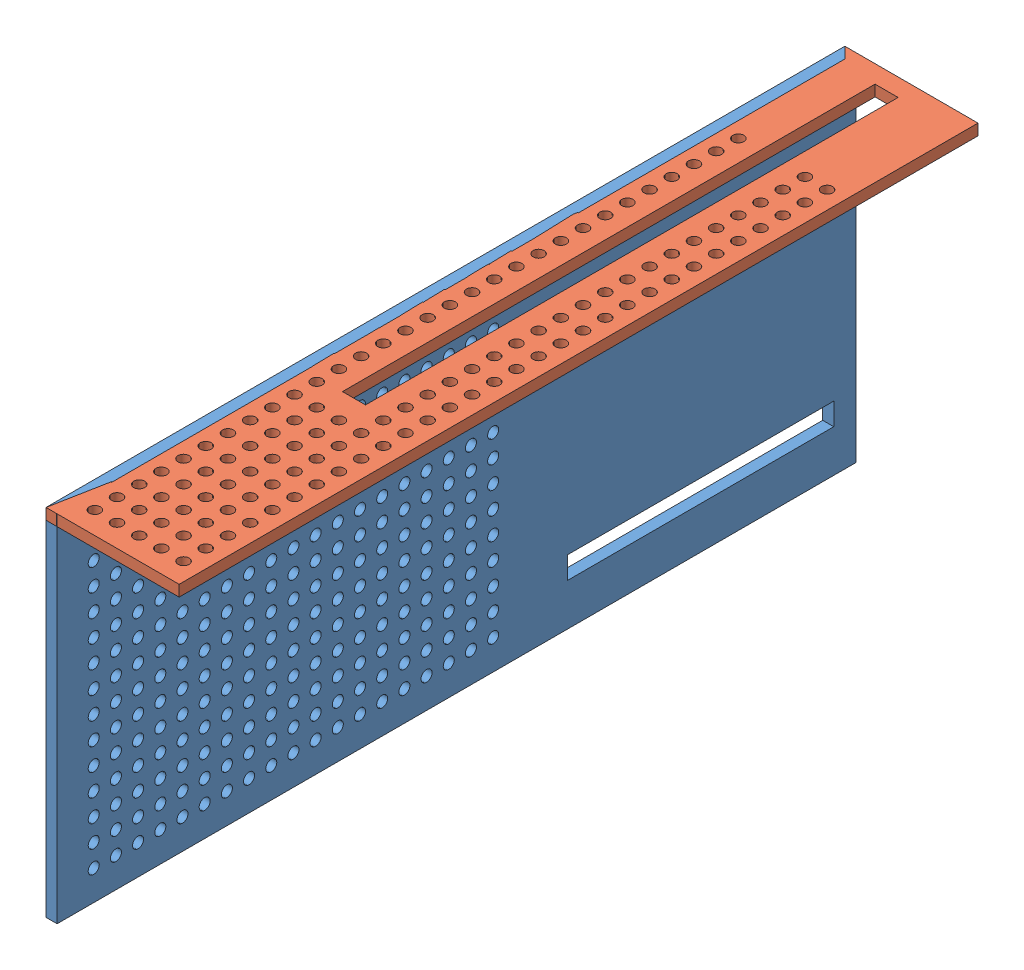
SolidWorks assembly Assem1.sldasm, configuration Default (file format 11000). Lengths in mm.
Overall size (38.1 101.6 228.6).
2 component instances, 2 part files, 4 mates.
Components (placement in the parent):
- Shroud_LargeSide-1: Shroud_LargeSide.SLDPRT [Default] at (16.8807 -11.9473 114.3) size (3.17 101.6 228.6)
- Shroud_ShortSide-1: Shroud_ShortSide.SLDPRT [Default] at (16.8807 -11.9473 114.3) size (38.1 80.26 228.6)
Mates (geometry in assembly coordinates):
- Coincident1: coincident: plane of Shroud_LargeSide-1 through (16.8807 -11.9473 114.3) normal (0 0 -1); plane of Shroud_ShortSide-1 through (29.4609 -11.9473 114.3) normal (0 0 -1)
- Coincident4: coincident: plane of Shroud_LargeSide-1 through (15.2932 38.8527 342.9) normal (0 1 0); plane of Shroud_ShortSide-1 through (15.2932 38.8527 342.9) normal (0 1 0)
- Coincident5: coincident: plane of Shroud_LargeSide-1 through (16.8807 -11.9473 114.3) normal (0 0 -1); plane of Shroud_ShortSide-1 through (16.8807 -11.9473 114.3) normal (0 0 -1)
- Coincident6: coincident: plane of Shroud_LargeSide-1 through (15.2932 -62.7473 342.9) normal (-1 0 0); plane of Shroud_ShortSide-1 through (15.2932 -62.7473 342.9) normal (-1 0 0)
